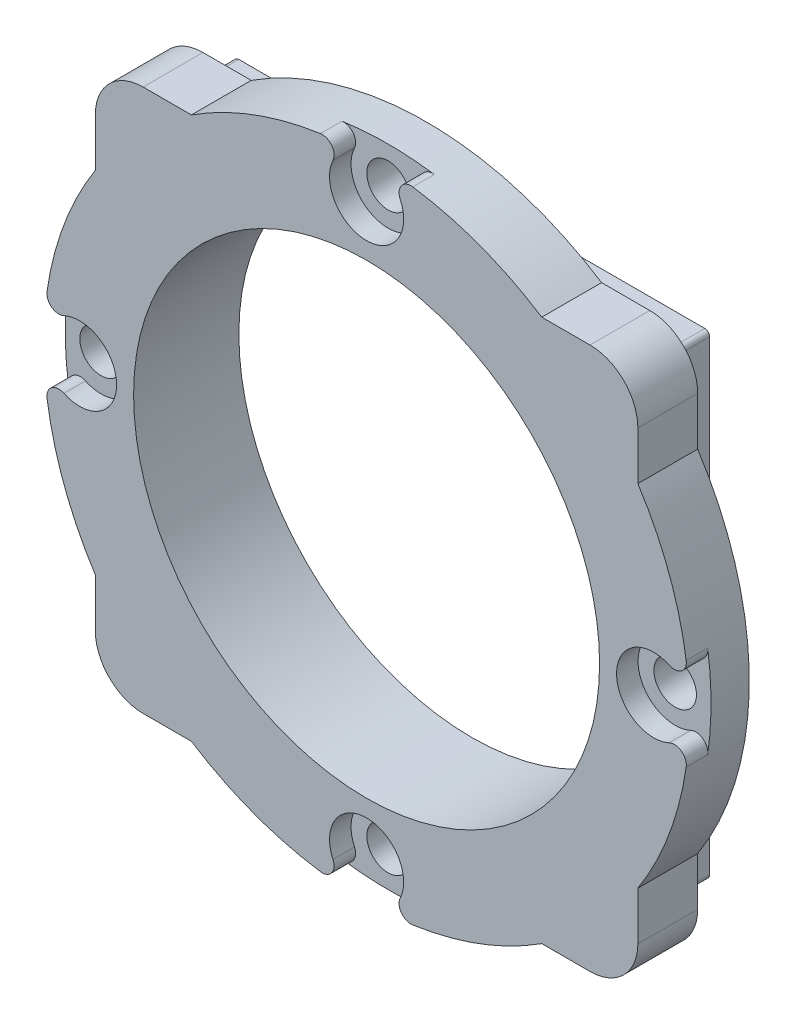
from build123d import *

# Parameters (mm, degrees)
SKETCH1_R                 = 12.7
BOSS_EXTRUDE1_DEPTH       = 6.35
SKETCH2_R                 = 17.145
BOSS_EXTRUDE2_DEPTH       = 44.45
SKETCH3_R                 = 12.5
CUT_EXTRUDE1_DEPTH        = 31.75
SKETCH5_W                 = 25.25
SKETCH5_H                 = 25.25
CUT_EXTRUDE3_DEPTH        = 38.1
CUT_EXTRUDE5_START        = -0.662668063
SKETCH11_R                = 17.145
CUT_EXTRUDE5_DEPTH        = 0.662668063
BOSS_EXTRUDE4_REACH       = 62.778
SKETCH4_R                 = 12.5
CUT_EXTRUDE2_DEPTH        = 13.70121453
SKETCH12_W                = 28.806
SKETCH12_H                = 28.806
SKETCH12_W_2              = 25.25
SKETCH12_H_2              = 25.25
BOSS_EXTRUDE5_DEPTH       = 33.631837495
FILLET3_R                 = 2.54
SKETCH14_R                = 12.5
CUT_EXTRUDE7_DEPTH        = 1.778
SKETCH6_R                 = 9.525
CUT_EXTRUDE8_DEPTH        = 72.644
SKETCH15_W                = 22.86
SKETCH15_H                = 22.86
CUT_EXTRUDE9_DEPTH        = 34.798
FILLET6_R                 = 1.27
SKETCH16_R                = 23.786874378
CUT_EXTRUDE10_DEPTH       = 46.962331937
SKETCH17_W                = 25.25
SKETCH17_H                = 25.25
SKETCH17_W_2              = 24.742
SKETCH17_H_2              = 24.742
BOSS_EXTRUDE6_DEPTH       = 5.588
FILLET7_R                 = 0.254
F_2_CLEARANCE_HOLE1_D     = 2.2606
F_2_CLEARANCE_HOLE1_DEPTH = 12.7
F_2_CLEARANCE_HOLE1_TIP   = 0.679152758
BOSS_EXTRUDE7_DEPTH       = 5.588
SKETCH25_R                = 1.9685
CUT_EXTRUDE12_DEPTH       = 1.143
FILLET8_R                 = 0.635
CIRPATTERN1_COUNT         = 4
FILLET8_OF_CIRPATTERN1_R  = 0.635
SKETCH26_W                = 24.797689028
SKETCH26_H                = 24.767665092
SKETCH26_R                = 12.371
BOSS_EXTRUDE8_DEPTH       = 5.588


with BuildPart() as part:
    # Sketch1 → Boss-Extrude1 (new body)
    with BuildSketch(Plane.XY):
        Circle(SKETCH1_R)
    extrude(amount=BOSS_EXTRUDE1_DEPTH)

    # Sketch2 → Boss-Extrude2 (add)
    with BuildSketch(Plane.XY.offset(6.35)):
        Circle(SKETCH2_R)
    extrude(amount=BOSS_EXTRUDE2_DEPTH)

    # Sketch3 → Cut-Extrude1 (cut)
    with BuildSketch(Plane.XY.offset(50.8)):
        Circle(SKETCH3_R)
    extrude(amount=-CUT_EXTRUDE1_DEPTH, mode=Mode.SUBTRACT)

    # Sketch5 → Cut-Extrude3 (cut)
    with BuildSketch(Plane.XY.offset(50.8)):
        Rectangle(SKETCH5_W, SKETCH5_H)
    extrude(amount=-CUT_EXTRUDE3_DEPTH, mode=Mode.SUBTRACT)

    # Sketch11 → Cut-Extrude5 (cut)
    with BuildSketch(Plane.XY.offset(50.8).offset(CUT_EXTRUDE5_START)):
        with Locations(Location((0, 0, 0), (0, 0, 222.577207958))):
            Circle(SKETCH11_R)
    extrude(amount=CUT_EXTRUDE5_DEPTH, mode=Mode.SUBTRACT)

    # Boss-Extrude4: up to this face of the body (flat: up to its plane)
    boss_extrude4_end = Plane(part.part.faces().sort_by_distance((-12.625, 0, 31.418665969))[0])
    # Sketch10 → Boss-Extrude4 (add, up to the picked face)
    with BuildSketch(Plane.ZY.offset(-12.625), mode=Mode.PRIVATE) as boss_extrude4_sk1:
        Polygon((44.893964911, -11.600017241), (20.638035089, 11.600017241), (12.7, 11.600017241), (12.7, -11.600017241), align=None)
    boss_extrude4_tool1 = split(extrude(boss_extrude4_sk1.sketch, amount=BOSS_EXTRUDE4_REACH, mode=Mode.PRIVATE), bisect_by=boss_extrude4_end, keep=Keep.BOTH, mode=Mode.PRIVATE)
    # Sketch10 → Boss-Extrude4 (add, up to the picked face)
    with BuildSketch(Plane.ZY.offset(-12.625), mode=Mode.PRIVATE) as boss_extrude4_sk2:
        Polygon((20.638035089, 11.600017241), (19.566402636, 12.625), (12.7, 12.625), (12.7, 11.600017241), align=None)
    boss_extrude4_tool2 = split(extrude(boss_extrude4_sk2.sketch, amount=BOSS_EXTRUDE4_REACH, mode=Mode.PRIVATE), bisect_by=boss_extrude4_end, keep=Keep.BOTH, mode=Mode.PRIVATE)
    # Sketch10 → Boss-Extrude4 (add, up to the picked face)
    with BuildSketch(Plane.ZY.offset(-12.625), mode=Mode.PRIVATE) as boss_extrude4_sk3:
        Polygon((45.965597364, -12.625), (44.893964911, -11.600017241), (12.7, -11.600017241), (12.7, -12.625), (18.861717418, -12.625), align=None)
    boss_extrude4_tool3 = split(extrude(boss_extrude4_sk3.sketch, amount=BOSS_EXTRUDE4_REACH, mode=Mode.PRIVATE), bisect_by=boss_extrude4_end, keep=Keep.BOTH, mode=Mode.PRIVATE)
    add(boss_extrude4_tool1.solids().sort_by(Axis((12.625, -2.337031, 23.954698), (-1, 0, 0)))[0])
    add(boss_extrude4_tool2.solids().sort_by(Axis((12.625, 12.100143, 16.407574), (-1, 0, 0)))[0])
    add(boss_extrude4_tool3.solids().sort_by(Axis((12.625, -12.115305, 29.066353), (-1, 0, 0)))[0])

    # Sketch4 → Cut-Extrude2 (cut)
    with BuildSketch(Plane(origin=(0, 25.4, 0), x_dir=(1, 0, 0), z_dir=(0, 1, 0))):
        with Locations((0, -33.02)):
            Circle(SKETCH4_R)
    extrude(amount=-CUT_EXTRUDE2_DEPTH, mode=Mode.SUBTRACT)


with BuildPart() as cut_extrude2_piece_1:
    # of the separate pieces the step leaves, piece 1, a body of its own (cut_extrude2_pieces)
    add(part.part.solids().sort_by_distance((17.145, 0, 6.35))[0])

    # Sketch12 → Boss-Extrude5 (add)
    with BuildSketch(Plane.XY.offset(50.137331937)):
        Rectangle(SKETCH12_W, SKETCH12_H)
        Rectangle(SKETCH12_W_2, SKETCH12_H_2, mode=Mode.SUBTRACT)
    extrude(amount=-BOSS_EXTRUDE5_DEPTH)

    # Fillet3
    fillet3_edges = [cut_extrude2_piece_1.edges().sort_by_distance(p)[0] for p in [
        (-14.403, -14.403, 33.32141319),
        (14.403, -14.403, 33.32141319),
        (14.403, 14.403, 33.32141319),
        (-14.403, 14.403, 33.32141319),
    ]]
    fillet(fillet3_edges, radius=FILLET3_R)


with BuildPart() as cut_extrude2_piece_2:
    # of the separate pieces the step leaves, piece 2, a body of its own (cut_extrude2_pieces)
    add(part.part.solids().sort_by_distance((-11.600017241, 12.625, 37.677209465))[0])

    # Combine1: union Cut-Extrude2 piece 1
    add(cut_extrude2_piece_1.part)

    # Sketch14 → Cut-Extrude7 (cut)
    with BuildSketch(Plane(origin=(0, 14.403, 0), x_dir=(1, 0, 0), z_dir=(0, 1, 0))):
        with Locations(Location((0, -33.02, 0), (0, 0, 270))):
            Circle(SKETCH14_R)
    extrude(amount=-CUT_EXTRUDE7_DEPTH, mode=Mode.SUBTRACT)

    # Sketch6 → Cut-Extrude8 (cut)
    with BuildSketch(Plane(origin=(0, 0, 0), x_dir=(-1, 0, 0), z_dir=(0, 0, -1))):
        Circle(SKETCH6_R)
    extrude(amount=-CUT_EXTRUDE8_DEPTH, mode=Mode.SUBTRACT)

    # Sketch15 → Cut-Extrude9 (cut)
    with BuildSketch(Plane.XY.offset(50.137331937)):
        Rectangle(SKETCH15_W, SKETCH15_H)
    extrude(amount=-CUT_EXTRUDE9_DEPTH, mode=Mode.SUBTRACT)

    # Fillet6
    fillet6_edges = [cut_extrude2_piece_2.edges().sort_by_distance(p)[0] for p in [
        (11.43, 0, 15.339331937),
        (0, -11.43, 15.339331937),
        (-11.43, 0, 15.339331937),
        (0, 11.43, 15.339331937),
    ]]
    fillet(fillet6_edges, radius=FILLET6_R)

    # Sketch16 → Cut-Extrude10 (cut)
    with BuildSketch(Plane(origin=(0, 0, 0), x_dir=(-1, 0, 0), z_dir=(0, 0, -1))):
        Circle(SKETCH16_R)
    extrude(amount=-CUT_EXTRUDE10_DEPTH, mode=Mode.SUBTRACT)


with BuildPart() as body_2:
    # Sketch17 → Boss-Extrude6 (new body)
    with BuildSketch(Plane.XY.offset(50.137331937)):
        Rectangle(SKETCH17_W, SKETCH17_H)
        Rectangle(SKETCH17_W_2, SKETCH17_H_2, mode=Mode.SUBTRACT)
    extrude(amount=-BOSS_EXTRUDE6_DEPTH)


with BuildPart() as cut_extrude2_piece_2_1:
    add(cut_extrude2_piece_2.part)

    # Combine2: union body 2
    add(body_2.part)

    # Fillet7
    fillet7_edges = [cut_extrude2_piece_2_1.edges().sort_by_distance(p)[0] for p in [
        (12.625, -12.625, 45.755831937),
        (12.625, 12.625, 45.755831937),
        (-12.625, 12.625, 45.755831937),
        (-12.625, -12.625, 45.755831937),
    ]]
    fillet(fillet7_edges, radius=FILLET7_R)

    # 2 Clearance Hole1
    with Locations(Plane.XY.offset(50.137331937)):
        with Locations((0, 15.24), (15.24, 0), (0, -15.24), (-15.24, 0)):
            Hole(F_2_CLEARANCE_HOLE1_D / 2, depth=F_2_CLEARANCE_HOLE1_DEPTH)
            with Locations((0, 0, -(F_2_CLEARANCE_HOLE1_DEPTH + F_2_CLEARANCE_HOLE1_TIP / 2))):  # 118° drill point
                Cone(0, F_2_CLEARANCE_HOLE1_D / 2, F_2_CLEARANCE_HOLE1_TIP, mode=Mode.SUBTRACT)

    # Sketch24 → Boss-Extrude7 (add)
    with BuildSketch(Plane.XY.offset(50.137331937)):
        with BuildLine():
            Line((-12.371, 12.371), (-12.371, 2.513699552))
            ThreePointArc((-12.371, 2.513699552), (-8.926374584, 8.926374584), (-2.513699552, 12.371))
            Line((-2.513699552, 12.371), (-12.371, 12.371))
        make_face()
        with BuildLine():
            ThreePointArc((-2.513699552, -12.371), (-8.926374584, -8.926374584), (-12.371, -2.513699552))
            Line((-12.371, -2.513699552), (-12.371, -12.371))
            Line((-12.371, -12.371), (-2.513699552, -12.371))
        make_face()
        with BuildLine():
            ThreePointArc((2.513699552, 12.371), (8.926374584, 8.926374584), (12.371, 2.513699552))
            Line((12.371, 2.513699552), (12.371, 12.371))
            Line((12.371, 12.371), (2.513699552, 12.371))
        make_face()
        with BuildLine():
            Line((12.371, -12.371), (12.371, -2.513699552))
            ThreePointArc((12.371, -2.513699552), (8.926374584, -8.926374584), (2.513699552, -12.371))
            Line((2.513699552, -12.371), (12.371, -12.371))
        make_face()
    extrude(amount=-BOSS_EXTRUDE7_DEPTH)

    # Sketch25 → Cut-Extrude12 (cut)
    with BuildSketch(Plane.XY.offset(50.137331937)):
        with Locations((0, 15.24)):
            Circle(SKETCH25_R)
    cut_extrude12 = extrude(amount=-CUT_EXTRUDE12_DEPTH, mode=Mode.SUBTRACT)

    # Fillet8
    fillet8_edges = [cut_extrude2_piece_2_1.edges().sort_by_distance(p)[0] for p in [
        (-0.525973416, 17.136930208, 49.565831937),
        (0.525973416, 17.136930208, 49.565831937),
    ]]
    fillet(fillet8_edges, radius=FILLET8_R)

    # CirPattern1: Cut-Extrude12 ×4 about axis
    cirpattern1_axis = Axis((0, 0, 0), (0, 0, 1))
    for i in range(1, CIRPATTERN1_COUNT):
        add(cut_extrude12.rotate(cirpattern1_axis, i * 360 / CIRPATTERN1_COUNT), mode=Mode.SUBTRACT)

    # Fillet8 of CirPattern1
    fillet8_of_cirpattern1_edges = [cut_extrude2_piece_2_1.edges().sort_by_distance(p)[0] for p in [
        (-17.136930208, -0.525973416, 49.565831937),
        (-17.136930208, 0.525973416, 49.565831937),
        (0.525973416, -17.136930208, 49.565831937),
        (-0.525973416, -17.136930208, 49.565831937),
        (17.136930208, 0.525973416, 49.565831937),
        (17.136930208, -0.525973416, 49.565831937),
    ]]
    fillet(fillet8_of_cirpattern1_edges, radius=FILLET8_OF_CIRPATTERN1_R)

    # Sketch26 → Boss-Extrude8 (add)
    with BuildSketch(Plane.XY.offset(50.137331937)):
        Rectangle(SKETCH26_W, SKETCH26_H)
        Circle(SKETCH26_R, mode=Mode.SUBTRACT)
    extrude(amount=-BOSS_EXTRUDE8_DEPTH)


solid = cut_extrude2_piece_2_1.part
